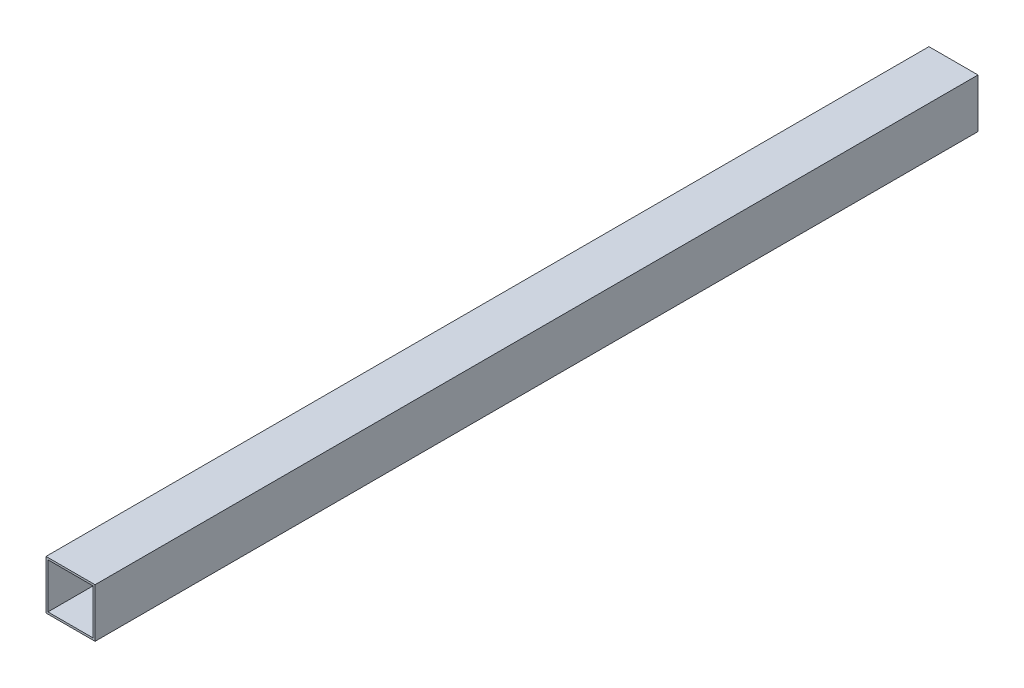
from build123d import *

# Parameters (mm, degrees)
SCHIZZO1_W                = 50
SCHIZZO1_H                = 50
SCHIZZO1_W_2              = 46
SCHIZZO1_H_2              = 46
ESTRUSIONE_SOTTILE1_DEPTH = 900


with BuildPart() as part:
    # Schizzo1 → Estrusione-Sottile1 (new body)
    with BuildSketch(Plane.XY):
        Rectangle(SCHIZZO1_W, SCHIZZO1_H)
        Rectangle(SCHIZZO1_W_2, SCHIZZO1_H_2, mode=Mode.SUBTRACT)
    extrude(amount=ESTRUSIONE_SOTTILE1_DEPTH)


solid = part.part
